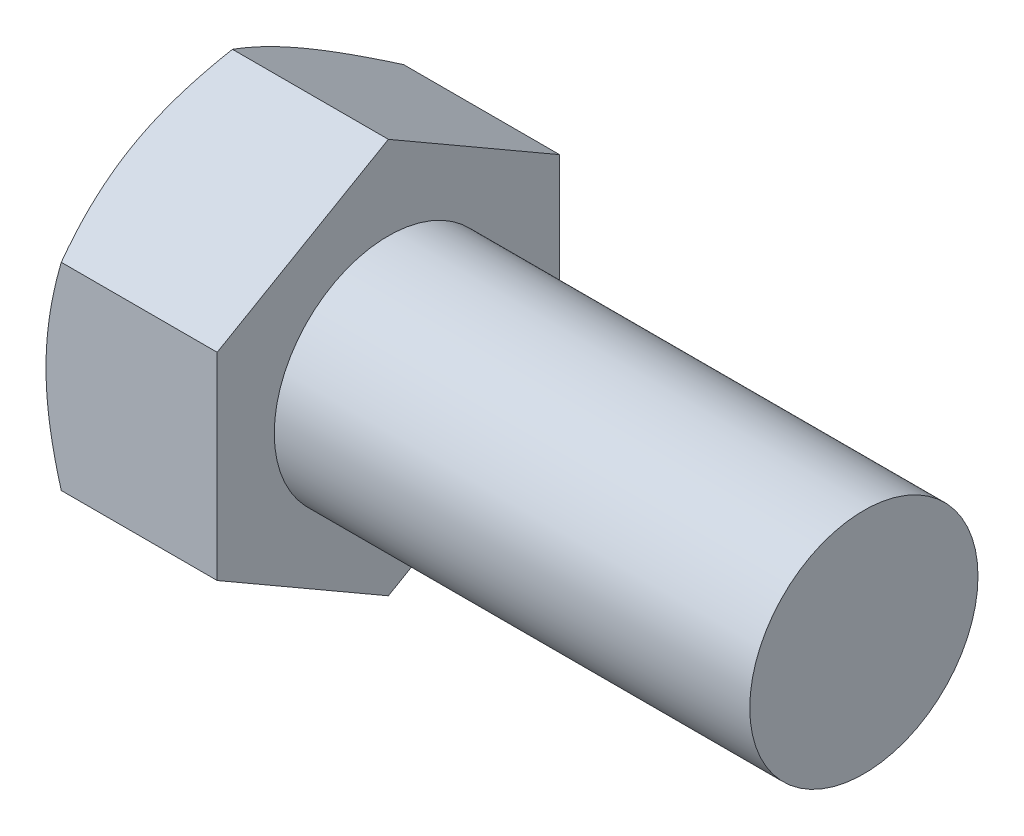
ISO-10303-21;
HEADER;
FILE_DESCRIPTION(('STEP AP214'),'2;1');
FILE_NAME('part.step','',(''),(''),'','','');
FILE_SCHEMA(('AUTOMOTIVE_DESIGN { 1 0 10303 214 1 1 1 1 }'));
ENDSEC;
DATA;
#1=APPLICATION_CONTEXT('core data for automotive mechanical design processes');
#2=APPLICATION_PROTOCOL_DEFINITION('international standard','automotive_design',2000,#1);
#3=PRODUCT_CONTEXT('',#1,'mechanical');
#4=PRODUCT('Part','Part','',(#3));
#5=PRODUCT_RELATED_PRODUCT_CATEGORY('part','',(#4));
#6=PRODUCT_DEFINITION_FORMATION('','',#4);
#7=PRODUCT_DEFINITION_CONTEXT('part definition',#1,'design');
#8=PRODUCT_DEFINITION('design','',#6,#7);
#9=PRODUCT_DEFINITION_SHAPE('','',#8);
#10=(LENGTH_UNIT() NAMED_UNIT(*) SI_UNIT(.MILLI.,.METRE.));
#11=(NAMED_UNIT(*) PLANE_ANGLE_UNIT() SI_UNIT($,.RADIAN.));
#12=(NAMED_UNIT(*) SI_UNIT($,.STERADIAN.) SOLID_ANGLE_UNIT());
#13=UNCERTAINTY_MEASURE_WITH_UNIT(LENGTH_MEASURE(1.E-05),#10,'distance_accuracy_value','');
#14=(GEOMETRIC_REPRESENTATION_CONTEXT(3) GLOBAL_UNCERTAINTY_ASSIGNED_CONTEXT((#13)) GLOBAL_UNIT_ASSIGNED_CONTEXT((#10,
#11,#12)) REPRESENTATION_CONTEXT('',''));
#15=CARTESIAN_POINT('',(0.,0.,0.));
#16=DIRECTION('',(0.,0.,1.));
#17=DIRECTION('',(1.,0.,0.));
#18=AXIS2_PLACEMENT_3D('',#15,#16,#17);
#19=CARTESIAN_POINT('',(9.,6.,0.));
#20=DIRECTION('',(-1.,0.,0.));
#21=DIRECTION('',(0.,0.,1.));
#22=AXIS2_PLACEMENT_3D('',#19,#20,#21);
#23=PLANE('',#22);
#24=CARTESIAN_POINT('',(9.,0.,0.));
#25=DIRECTION('',(-1.,0.,0.));
#26=DIRECTION('',(0.,0.,1.));
#27=AXIS2_PLACEMENT_3D('',#24,#25,#26);
#28=CIRCLE('',#27,6.);
#29=CARTESIAN_POINT('',(9.,0.,6.));
#30=VERTEX_POINT('',#29);
#31=EDGE_CURVE('E200',#30,#30,#28,.T.);
#32=ORIENTED_EDGE('',*,*,#31,.T.);
#33=EDGE_LOOP('',(#32));
#34=FACE_BOUND('',#33,.T.);
#35=DIRECTION('',(0.,1.,0.));
#36=VECTOR('',#35,1.);
#37=CARTESIAN_POINT('',(9.,-5.19615244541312,9.));
#38=LINE('',#37,#36);
#39=CARTESIAN_POINT('',(9.,-5.19615244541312,9.));
#40=VERTEX_POINT('',#39);
#41=CARTESIAN_POINT('',(9.,5.19615244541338,9.));
#42=VERTEX_POINT('',#41);
#43=EDGE_CURVE('E60',#40,#42,#38,.T.);
#44=ORIENTED_EDGE('',*,*,#43,.F.);
#45=DIRECTION('',(0.,0.500000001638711,0.866025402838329));
#46=VECTOR('',#45,1.);
#47=CARTESIAN_POINT('',(9.,-10.3923048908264,0.));
#48=LINE('',#47,#46);
#49=CARTESIAN_POINT('',(9.,-10.3923048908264,0.));
#50=VERTEX_POINT('',#49);
#51=EDGE_CURVE('E133',#50,#40,#48,.T.);
#52=ORIENTED_EDGE('',*,*,#51,.F.);
#53=DIRECTION('',(0.,-0.500000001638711,0.866025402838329));
#54=VECTOR('',#53,1.);
#55=CARTESIAN_POINT('',(9.,-5.19615244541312,-9.));
#56=LINE('',#55,#54);
#57=CARTESIAN_POINT('',(9.,-5.19615244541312,-9.));
#58=VERTEX_POINT('',#57);
#59=EDGE_CURVE('E131',#58,#50,#56,.T.);
#60=ORIENTED_EDGE('',*,*,#59,.F.);
#61=DIRECTION('',(0.,-1.,0.));
#62=VECTOR('',#61,1.);
#63=CARTESIAN_POINT('',(9.,5.19615244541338,-9.));
#64=LINE('',#63,#62);
#65=CARTESIAN_POINT('',(9.,5.19615244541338,-9.));
#66=VERTEX_POINT('',#65);
#67=EDGE_CURVE('E114',#66,#58,#64,.T.);
#68=ORIENTED_EDGE('',*,*,#67,.F.);
#69=DIRECTION('',(0.,-0.500000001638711,-0.866025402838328));
#70=VECTOR('',#69,1.);
#71=CARTESIAN_POINT('',(9.,10.3923048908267,0.));
#72=LINE('',#71,#70);
#73=CARTESIAN_POINT('',(9.,10.3923048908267,0.));
#74=VERTEX_POINT('',#73);
#75=EDGE_CURVE('E123',#74,#66,#72,.T.);
#76=ORIENTED_EDGE('',*,*,#75,.F.);
#77=DIRECTION('',(0.,0.500000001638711,-0.866025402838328));
#78=VECTOR('',#77,1.);
#79=CARTESIAN_POINT('',(9.,5.19615244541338,9.));
#80=LINE('',#79,#78);
#81=EDGE_CURVE('E127',#42,#74,#80,.T.);
#82=ORIENTED_EDGE('',*,*,#81,.F.);
#83=EDGE_LOOP('',(#44,#52,#60,#68,#76,#82));
#84=FACE_BOUND('',#83,.T.);
#85=ADVANCED_FACE('F37',(#34,#84),#23,.F.);
#86=CARTESIAN_POINT('',(-25.4,0.,0.));
#87=DIRECTION('',(-1.,0.,0.));
#88=DIRECTION('',(0.,0.,1.));
#89=AXIS2_PLACEMENT_3D('',#86,#87,#88);
#90=CYLINDRICAL_SURFACE('',#89,6.);
#91=CARTESIAN_POINT('',(34.,0.,0.));
#92=DIRECTION('',(-1.,0.,0.));
#93=DIRECTION('',(0.,0.,1.));
#94=AXIS2_PLACEMENT_3D('',#91,#92,#93);
#95=CIRCLE('',#94,6.);
#96=CARTESIAN_POINT('',(34.,0.,6.));
#97=VERTEX_POINT('',#96);
#98=EDGE_CURVE('E11',#97,#97,#95,.T.);
#99=ORIENTED_EDGE('',*,*,#98,.T.);
#100=EDGE_LOOP('',(#99));
#101=FACE_BOUND('',#100,.T.);
#102=ORIENTED_EDGE('',*,*,#31,.F.);
#103=EDGE_LOOP('',(#102));
#104=FACE_BOUND('',#103,.T.);
#105=ADVANCED_FACE('F39',(#101,#104),#90,.T.);
#106=CARTESIAN_POINT('',(34.,6.,0.));
#107=DIRECTION('',(1.,0.,0.));
#108=DIRECTION('',(0.,0.,-1.));
#109=AXIS2_PLACEMENT_3D('',#106,#107,#108);
#110=PLANE('',#109);
#111=ORIENTED_EDGE('',*,*,#98,.F.);
#112=EDGE_LOOP('',(#111));
#113=FACE_BOUND('',#112,.T.);
#114=ADVANCED_FACE('F181',(#113),#110,.T.);
#115=CARTESIAN_POINT('',(9.,-5.19615244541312,9.));
#116=DIRECTION('',(0.,0.,1.));
#117=DIRECTION('',(0.,-1.,0.));
#118=AXIS2_PLACEMENT_3D('',#115,#116,#117);
#119=PLANE('',#118);
#120=DIRECTION('',(-1.,0.,0.));
#121=VECTOR('',#120,1.);
#122=CARTESIAN_POINT('',(9.,-5.19615244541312,9.));
#123=LINE('',#122,#121);
#124=CARTESIAN_POINT('',(0.803847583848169,-5.19615244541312,9.));
#125=VERTEX_POINT('',#124);
#126=EDGE_CURVE('E140',#40,#125,#123,.T.);
#127=ORIENTED_EDGE('',*,*,#126,.F.);
#128=ORIENTED_EDGE('',*,*,#43,.T.);
#129=DIRECTION('',(-1.,0.,0.));
#130=VECTOR('',#129,1.);
#131=CARTESIAN_POINT('',(9.,5.19615244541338,9.));
#132=LINE('',#131,#130);
#133=CARTESIAN_POINT('',(0.803847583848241,5.19615244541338,9.));
#134=VERTEX_POINT('',#133);
#135=EDGE_CURVE('E139',#42,#134,#132,.T.);
#136=ORIENTED_EDGE('',*,*,#135,.T.);
#137=CARTESIAN_POINT('',(4.30675215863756,-13.7809864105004,9.00000000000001));
#138=CARTESIAN_POINT('',(4.21125056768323,-13.5834182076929,9.00000000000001));
#139=CARTESIAN_POINT('',(4.11624323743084,-13.3856112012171,9.00000000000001));
#140=CARTESIAN_POINT('',(3.92733055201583,-12.9894691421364,9.00000000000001));
#141=CARTESIAN_POINT('',(3.83342520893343,-12.7911340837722,9.));
#142=CARTESIAN_POINT('',(3.55350512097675,-12.1952030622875,9.));
#143=CARTESIAN_POINT('',(3.36931745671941,-11.7967454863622,9.));
#144=CARTESIAN_POINT('',(3.00594950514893,-10.9947966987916,9.));
#145=CARTESIAN_POINT('',(2.82680390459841,-10.5912897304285,9.));
#146=CARTESIAN_POINT('',(2.47620436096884,-9.78096004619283,9.));
#147=CARTESIAN_POINT('',(2.30475001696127,-9.3741375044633,9.));
#148=CARTESIAN_POINT('',(1.96954751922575,-8.55147796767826,9.));
#149=CARTESIAN_POINT('',(1.80591981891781,-8.13559162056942,9.));
#150=CARTESIAN_POINT('',(1.49147930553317,-7.29891466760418,9.));
#151=CARTESIAN_POINT('',(1.34066791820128,-6.87812352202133,9.));
#152=CARTESIAN_POINT('',(1.05591315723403,-6.0318265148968,9.));
#153=CARTESIAN_POINT('',(0.92193392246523,-5.60633285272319,9.));
#154=CARTESIAN_POINT('',(0.675192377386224,-4.74931186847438,9.));
#155=CARTESIAN_POINT('',(0.562423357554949,-4.3177865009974,9.));
#156=CARTESIAN_POINT('',(0.363585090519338,-3.44833526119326,9.));
#157=CARTESIAN_POINT('',(0.277522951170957,-3.01040771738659,9.));
#158=CARTESIAN_POINT('',(0.172769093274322,-2.34966278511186,9.));
#159=CARTESIAN_POINT('',(0.141905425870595,-2.12874509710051,9.));
#160=CARTESIAN_POINT('',(0.0888984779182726,-1.68587395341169,9.));
#161=CARTESIAN_POINT('',(0.0667543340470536,-1.46392060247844,9.));
#162=CARTESIAN_POINT('',(0.0317823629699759,-1.02068615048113,9.));
#163=CARTESIAN_POINT('',(0.0188966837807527,-0.799409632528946,9.));
#164=CARTESIAN_POINT('',(0.00250976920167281,-0.356509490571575,9.));
#165=CARTESIAN_POINT('',(-0.000991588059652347,-0.134885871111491,9.));
#166=CARTESIAN_POINT('',(0.00147357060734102,0.308247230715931,9.));
#167=CARTESIAN_POINT('',(0.00743742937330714,0.529756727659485,9.));
#168=CARTESIAN_POINT('',(0.0286847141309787,0.972331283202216,9.));
#169=CARTESIAN_POINT('',(0.0439686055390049,1.19339631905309,9.));
#170=CARTESIAN_POINT('',(0.0919878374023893,1.729189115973,9.));
#171=CARTESIAN_POINT('',(0.129392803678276,2.04350522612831,9.));
#172=CARTESIAN_POINT('',(0.22096768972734,2.66972888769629,9.));
#173=CARTESIAN_POINT('',(0.275142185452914,2.98163575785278,9.));
#174=CARTESIAN_POINT('',(0.398334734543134,3.60278361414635,9.));
#175=CARTESIAN_POINT('',(0.467366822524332,3.91202179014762,9.));
#176=CARTESIAN_POINT('',(0.618168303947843,4.52731652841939,9.));
#177=CARTESIAN_POINT('',(0.699936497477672,4.83337338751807,9.));
#178=CARTESIAN_POINT('',(0.876391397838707,5.44984363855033,9.));
#179=CARTESIAN_POINT('',(0.971345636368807,5.76017992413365,9.));
#180=CARTESIAN_POINT('',(1.17063619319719,6.37757223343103,9.));
#181=CARTESIAN_POINT('',(1.27496604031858,6.68463035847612,9.));
#182=CARTESIAN_POINT('',(1.49085277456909,7.29423423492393,9.));
#183=CARTESIAN_POINT('',(1.60236567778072,7.59679565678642,9.));
#184=CARTESIAN_POINT('',(1.83193669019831,8.19957103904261,9.));
#185=CARTESIAN_POINT('',(1.9499974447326,8.49978399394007,9.));
#186=CARTESIAN_POINT('',(2.07068439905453,8.79890630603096,9.));
#187=B_SPLINE_CURVE_WITH_KNOTS('',3,(#137,#138,#139,#140,#141,#142,#143,#144,#145,#146,#147,
#148,#149,#150,#151,#152,#153,#154,#155,#156,#157,#158,#159,#160,#161,#162,#163,#164,#165,#166,
#167,#168,#169,#170,#171,#172,#173,#174,#175,#176,#177,#178,#179,#180,#181,#182,#183,#184,#185,
#186),.UNSPECIFIED.,.F.,.F.,(4,2,2,2,2,2,2,2,2,2,2,2,2,2,2,2,2,2,2,2,2,2,2,2,4),(0.,
0.658317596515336,1.31664240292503,2.63350615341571,3.95790574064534,5.28223620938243,
6.62282571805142,7.96356416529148,9.3013958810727,10.6388036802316,11.9765671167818,
12.6456116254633,13.3145898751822,13.9793507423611,14.6441029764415,15.3086686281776,
15.9732674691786,16.9223404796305,17.8716726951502,18.8219056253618,19.772049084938,
20.7454827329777,21.7182495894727,22.6855410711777,23.6532262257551),.UNSPECIFIED.);
#188=CARTESIAN_POINT('',(0.,0.,9.));
#189=VERTEX_POINT('',#188);
#190=EDGE_CURVE('E183',#189,#134,#187,.T.);
#191=ORIENTED_EDGE('',*,*,#190,.F.);
#192=EDGE_CURVE('E191',#125,#189,#187,.T.);
#193=ORIENTED_EDGE('',*,*,#192,.F.);
#194=EDGE_LOOP('',(#127,#128,#136,#191,#193));
#195=FACE_BOUND('',#194,.T.);
#196=ADVANCED_FACE('F177',(#195),#119,.T.);
#197=CARTESIAN_POINT('',(9.,-10.3923048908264,0.));
#198=DIRECTION('',(0.,-0.866025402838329,0.500000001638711));
#199=DIRECTION('',(0.,-0.500000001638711,-0.866025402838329));
#200=AXIS2_PLACEMENT_3D('',#197,#198,#199);
#201=PLANE('',#200);
#202=DIRECTION('',(-1.,0.,0.));
#203=VECTOR('',#202,1.);
#204=CARTESIAN_POINT('',(9.,-10.3923048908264,0.));
#205=LINE('',#204,#203);
#206=CARTESIAN_POINT('',(0.803847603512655,-10.3923048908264,0.));
#207=VERTEX_POINT('',#206);
#208=EDGE_CURVE('E144',#50,#207,#205,.T.);
#209=ORIENTED_EDGE('',*,*,#208,.F.);
#210=ORIENTED_EDGE('',*,*,#51,.T.);
#211=ORIENTED_EDGE('',*,*,#126,.T.);
#212=CARTESIAN_POINT('',(0.803914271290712,-10.3924203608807,-0.000200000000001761));
#213=CARTESIAN_POINT('',(0.737982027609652,-10.2782164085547,0.197607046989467));
#214=CARTESIAN_POINT('',(0.675041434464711,-10.1635670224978,0.396185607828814));
#215=CARTESIAN_POINT('',(0.555969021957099,-9.93333719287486,0.794955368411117));
#216=CARTESIAN_POINT('',(0.499840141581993,-9.81775637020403,0.995147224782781));
#217=CARTESIAN_POINT('',(0.395151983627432,-9.58544919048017,1.39751506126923));
#218=CARTESIAN_POINT('',(0.346610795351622,-9.46872078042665,1.59969459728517));
#219=CARTESIAN_POINT('',(0.258148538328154,-9.23447005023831,2.00542876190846));
#220=CARTESIAN_POINT('',(0.218225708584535,-9.11694789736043,2.20898310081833));
#221=CARTESIAN_POINT('',(0.148684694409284,-8.88408936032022,2.61230591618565));
#222=CARTESIAN_POINT('',(0.118837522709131,-8.76877017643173,2.81204460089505));
#223=CARTESIAN_POINT('',(0.0687933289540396,-8.53761582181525,3.21241568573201));
#224=CARTESIAN_POINT('',(0.048595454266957,-8.4217806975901,3.41304800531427));
#225=CARTESIAN_POINT('',(0.0183543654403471,-8.18990952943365,3.81466064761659));
#226=CARTESIAN_POINT('',(0.00829962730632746,-8.07387386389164,4.01564031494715));
#227=CARTESIAN_POINT('',(-0.00143764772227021,-7.84169574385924,4.41778461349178));
#228=CARTESIAN_POINT('',(-0.0011205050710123,-7.72555329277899,4.61894923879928));
#229=CARTESIAN_POINT('',(0.00916396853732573,-7.50842144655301,4.99503262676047));
#230=CARTESIAN_POINT('',(0.0178767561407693,-7.40741674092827,5.16997790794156));
#231=CARTESIAN_POINT('',(0.0429773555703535,-7.20564391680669,5.5194586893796));
#232=CARTESIAN_POINT('',(0.059365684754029,-7.10487581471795,5.69399416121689));
#233=CARTESIAN_POINT('',(0.119656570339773,-6.80296161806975,6.21692488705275));
#234=CARTESIAN_POINT('',(0.174677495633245,-6.60234992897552,6.56439452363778));
#235=CARTESIAN_POINT('',(0.312230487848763,-6.1989985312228,7.26301963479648));
#236=CARTESIAN_POINT('',(0.395345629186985,-5.99631029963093,7.61408594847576));
#237=CARTESIAN_POINT('',(0.583982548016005,-5.59395642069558,8.31098330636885));
#238=CARTESIAN_POINT('',(0.689460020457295,-5.39428562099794,8.65682327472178));
#239=CARTESIAN_POINT('',(0.803914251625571,-5.19603697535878,9.0002));
#240=B_SPLINE_CURVE_WITH_KNOTS('',3,(#212,#213,#214,#215,#216,#217,#218,#219,#220,#221,#222,
#223,#224,#225,#226,#227,#228,#229,#230,#231,#232,#233,#234,#235,#236,#237,#238,#239),
.UNSPECIFIED.,.F.,.F.,(4,2,2,2,2,2,2,2,2,2,2,2,2,4),(0.,0.713219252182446,1.42674514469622,
2.14194698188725,2.8570025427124,3.55449750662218,4.25193082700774,4.94857087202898,
5.6451893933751,6.25162978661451,6.85811106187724,8.07193749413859,9.31268393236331,
10.5509947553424),.UNSPECIFIED.);
#241=CARTESIAN_POINT('',(0.,-7.79422865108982,4.50000002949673));
#242=VERTEX_POINT('',#241);
#243=EDGE_CURVE('E193',#242,#125,#240,.T.);
#244=ORIENTED_EDGE('',*,*,#243,.F.);
#245=EDGE_CURVE('E192',#207,#242,#240,.T.);
#246=ORIENTED_EDGE('',*,*,#245,.F.);
#247=EDGE_LOOP('',(#209,#210,#211,#244,#246));
#248=FACE_BOUND('',#247,.T.);
#249=ADVANCED_FACE('F180',(#248),#201,.T.);
#250=CARTESIAN_POINT('',(9.,-5.19615244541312,-9.));
#251=DIRECTION('',(0.,-0.866025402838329,-0.500000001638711));
#252=DIRECTION('',(0.,0.500000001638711,-0.866025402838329));
#253=AXIS2_PLACEMENT_3D('',#250,#251,#252);
#254=PLANE('',#253);
#255=DIRECTION('',(-1.,0.,0.));
#256=VECTOR('',#255,1.);
#257=CARTESIAN_POINT('',(9.,-5.19615244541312,-9.));
#258=LINE('',#257,#256);
#259=CARTESIAN_POINT('',(0.803847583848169,-5.19615244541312,-9.));
#260=VERTEX_POINT('',#259);
#261=EDGE_CURVE('E120',#58,#260,#258,.T.);
#262=ORIENTED_EDGE('',*,*,#261,.F.);
#263=ORIENTED_EDGE('',*,*,#59,.T.);
#264=ORIENTED_EDGE('',*,*,#208,.T.);
#265=CARTESIAN_POINT('',(0.803914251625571,-5.19603697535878,-9.0002));
#266=CARTESIAN_POINT('',(0.737982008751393,-5.310240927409,-8.80239295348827));
#267=CARTESIAN_POINT('',(0.675041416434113,-5.42489031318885,-8.60381439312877));
#268=CARTESIAN_POINT('',(0.55596900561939,-5.65512014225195,-8.20504463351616));
#269=CARTESIAN_POINT('',(0.499840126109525,-5.77070096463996,-8.00485277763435));
#270=CARTESIAN_POINT('',(0.395151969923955,-6.00300814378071,-7.60248494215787));
#271=CARTESIAN_POINT('',(0.34661078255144,-6.11973655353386,-7.40030540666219));
#272=CARTESIAN_POINT('',(0.258148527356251,-6.3539872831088,-6.99457124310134));
#273=CARTESIAN_POINT('',(0.21822569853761,-6.47150943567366,-6.79101690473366));
#274=CARTESIAN_POINT('',(0.148684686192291,-6.70436797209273,-6.38769409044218));
#275=CARTESIAN_POINT('',(0.118837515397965,-6.81968715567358,-6.18795540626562));
#276=CARTESIAN_POINT('',(0.0687933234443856,-7.05084150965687,-5.78758432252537));
#277=CARTESIAN_POINT('',(0.0485954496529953,-7.16667663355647,-5.58695200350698));
#278=CARTESIAN_POINT('',(0.0183543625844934,-7.39854780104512,-5.18533936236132));
#279=CARTESIAN_POINT('',(0.00829962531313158,-7.5145834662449,-4.98435969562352));
#280=CARTESIAN_POINT('',(-0.001437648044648,-7.74676158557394,-4.58221539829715));
#281=CARTESIAN_POINT('',(-0.00112050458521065,-7.86290403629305,-4.38105077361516));
#282=CARTESIAN_POINT('',(0.00916397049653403,-8.08003588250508,-4.00496738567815));
#283=CARTESIAN_POINT('',(0.0178767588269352,-8.18104058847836,-3.83002210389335));
#284=CARTESIAN_POINT('',(0.0429773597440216,-8.3828134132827,-3.48054132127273));
#285=CARTESIAN_POINT('',(0.0593656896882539,-8.48358151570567,-3.30600584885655));
#286=CARTESIAN_POINT('',(0.119656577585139,-8.78549571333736,-2.78307512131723));
#287=CARTESIAN_POINT('',(0.174677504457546,-8.98610740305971,-2.43560548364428));
#288=CARTESIAN_POINT('',(0.312230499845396,-9.3894588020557,-1.73698037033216));
#289=CARTESIAN_POINT('',(0.395345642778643,-9.59214703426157,-1.38591405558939));
#290=CARTESIAN_POINT('',(0.583982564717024,-9.9945009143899,-0.689016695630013));
#291=CARTESIAN_POINT('',(0.689460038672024,-10.1941717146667,-0.343176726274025));
#292=CARTESIAN_POINT('',(0.803914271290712,-10.3924203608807,0.000199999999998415));
#293=B_SPLINE_CURVE_WITH_KNOTS('',3,(#265,#266,#267,#268,#269,#270,#271,#272,#273,#274,#275,
#276,#277,#278,#279,#280,#281,#282,#283,#284,#285,#286,#287,#288,#289,#290,#291,#292),
.UNSPECIFIED.,.F.,.F.,(4,2,2,2,2,2,2,2,2,2,2,2,2,4),(0.,0.713219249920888,1.42674514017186,
2.14194697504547,2.85700253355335,3.55449749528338,4.25193081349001,4.94857085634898,
5.64518937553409,6.25162977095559,6.85811104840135,8.07193748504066,9.31268392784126,
10.5509947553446),.UNSPECIFIED.);
#294=CARTESIAN_POINT('',(0.,-7.79422865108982,-4.50000002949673));
#295=VERTEX_POINT('',#294);
#296=EDGE_CURVE('E223',#295,#207,#293,.T.);
#297=ORIENTED_EDGE('',*,*,#296,.F.);
#298=EDGE_CURVE('E228',#260,#295,#293,.T.);
#299=ORIENTED_EDGE('',*,*,#298,.F.);
#300=EDGE_LOOP('',(#262,#263,#264,#297,#299));
#301=FACE_BOUND('',#300,.T.);
#302=ADVANCED_FACE('F299',(#301),#254,.T.);
#303=CARTESIAN_POINT('',(9.,5.19615244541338,-9.));
#304=DIRECTION('',(0.,0.,-1.));
#305=DIRECTION('',(-1.,0.,0.));
#306=AXIS2_PLACEMENT_3D('',#303,#304,#305);
#307=PLANE('',#306);
#308=DIRECTION('',(-1.,0.,0.));
#309=VECTOR('',#308,1.);
#310=CARTESIAN_POINT('',(9.,5.19615244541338,-9.));
#311=LINE('',#310,#309);
#312=CARTESIAN_POINT('',(0.803847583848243,5.19615244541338,-9.));
#313=VERTEX_POINT('',#312);
#314=EDGE_CURVE('E109',#66,#313,#311,.T.);
#315=ORIENTED_EDGE('',*,*,#314,.F.);
#316=ORIENTED_EDGE('',*,*,#67,.T.);
#317=ORIENTED_EDGE('',*,*,#261,.T.);
#318=CARTESIAN_POINT('',(4.30675215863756,-13.7809864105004,-9.));
#319=CARTESIAN_POINT('',(4.21125056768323,-13.5834182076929,-9.));
#320=CARTESIAN_POINT('',(4.11624323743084,-13.3856112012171,-9.));
#321=CARTESIAN_POINT('',(3.92733055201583,-12.9894691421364,-9.));
#322=CARTESIAN_POINT('',(3.83342520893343,-12.7911340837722,-9.));
#323=CARTESIAN_POINT('',(3.55350512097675,-12.1952030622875,-9.));
#324=CARTESIAN_POINT('',(3.36931745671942,-11.7967454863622,-9.));
#325=CARTESIAN_POINT('',(3.00594950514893,-10.9947966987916,-9.));
#326=CARTESIAN_POINT('',(2.82680390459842,-10.5912897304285,-9.));
#327=CARTESIAN_POINT('',(2.47620436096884,-9.78096004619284,-9.));
#328=CARTESIAN_POINT('',(2.30475001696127,-9.37413750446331,-9.));
#329=CARTESIAN_POINT('',(1.96954751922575,-8.55147796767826,-9.));
#330=CARTESIAN_POINT('',(1.80591981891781,-8.13559162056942,-9.));
#331=CARTESIAN_POINT('',(1.49147930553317,-7.29891466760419,-9.));
#332=CARTESIAN_POINT('',(1.34066791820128,-6.87812352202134,-9.));
#333=CARTESIAN_POINT('',(1.05591315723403,-6.0318265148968,-9.));
#334=CARTESIAN_POINT('',(0.921933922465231,-5.60633285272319,-9.));
#335=CARTESIAN_POINT('',(0.675192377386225,-4.74931186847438,-9.));
#336=CARTESIAN_POINT('',(0.562423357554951,-4.3177865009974,-9.));
#337=CARTESIAN_POINT('',(0.363585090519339,-3.44833526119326,-9.));
#338=CARTESIAN_POINT('',(0.277522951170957,-3.01040771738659,-9.));
#339=CARTESIAN_POINT('',(0.172769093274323,-2.34966278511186,-9.));
#340=CARTESIAN_POINT('',(0.141905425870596,-2.12874509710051,-9.));
#341=CARTESIAN_POINT('',(0.088898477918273,-1.68587395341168,-9.));
#342=CARTESIAN_POINT('',(0.0667543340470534,-1.46392060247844,-9.));
#343=CARTESIAN_POINT('',(0.0317823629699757,-1.02068615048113,-9.));
#344=CARTESIAN_POINT('',(0.0188966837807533,-0.799409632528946,-9.));
#345=CARTESIAN_POINT('',(0.00250976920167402,-0.356509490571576,-9.));
#346=CARTESIAN_POINT('',(-0.000991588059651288,-0.134885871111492,-9.));
#347=CARTESIAN_POINT('',(0.001473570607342,0.308247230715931,-9.));
#348=CARTESIAN_POINT('',(0.0074374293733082,0.529756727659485,-9.));
#349=CARTESIAN_POINT('',(0.0286847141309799,0.972331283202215,-9.));
#350=CARTESIAN_POINT('',(0.0439686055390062,1.19339631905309,-9.));
#351=CARTESIAN_POINT('',(0.0919878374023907,1.729189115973,-9.));
#352=CARTESIAN_POINT('',(0.129392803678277,2.04350522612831,-9.));
#353=CARTESIAN_POINT('',(0.220967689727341,2.66972888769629,-9.));
#354=CARTESIAN_POINT('',(0.275142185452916,2.98163575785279,-9.));
#355=CARTESIAN_POINT('',(0.398334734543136,3.60278361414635,-9.));
#356=CARTESIAN_POINT('',(0.467366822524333,3.91202179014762,-9.));
#357=CARTESIAN_POINT('',(0.618168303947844,4.52731652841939,-9.));
#358=CARTESIAN_POINT('',(0.699936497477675,4.83337338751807,-9.));
#359=CARTESIAN_POINT('',(0.876391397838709,5.44984363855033,-9.));
#360=CARTESIAN_POINT('',(0.971345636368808,5.76017992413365,-9.));
#361=CARTESIAN_POINT('',(1.17063619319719,6.37757223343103,-9.));
#362=CARTESIAN_POINT('',(1.27496604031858,6.68463035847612,-9.));
#363=CARTESIAN_POINT('',(1.49085277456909,7.29423423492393,-9.));
#364=CARTESIAN_POINT('',(1.60236567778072,7.59679565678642,-9.));
#365=CARTESIAN_POINT('',(1.83193669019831,8.19957103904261,-9.));
#366=CARTESIAN_POINT('',(1.94999744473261,8.49978399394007,-9.));
#367=CARTESIAN_POINT('',(2.07068439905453,8.79890630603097,-9.));
#368=B_SPLINE_CURVE_WITH_KNOTS('',3,(#318,#319,#320,#321,#322,#323,#324,#325,#326,#327,#328,
#329,#330,#331,#332,#333,#334,#335,#336,#337,#338,#339,#340,#341,#342,#343,#344,#345,#346,#347,
#348,#349,#350,#351,#352,#353,#354,#355,#356,#357,#358,#359,#360,#361,#362,#363,#364,#365,#366,
#367),.UNSPECIFIED.,.F.,.F.,(4,2,2,2,2,2,2,2,2,2,2,2,2,2,2,2,2,2,2,2,2,2,2,2,4),(0.,
0.658317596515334,1.31664240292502,2.6335061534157,3.95790574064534,5.28223620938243,
6.62282571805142,7.96356416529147,9.3013958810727,10.6388036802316,11.9765671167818,
12.6456116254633,13.3145898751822,13.9793507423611,14.6441029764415,15.3086686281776,
15.9732674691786,16.9223404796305,17.8716726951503,18.8219056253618,19.772049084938,
20.7454827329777,21.7182495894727,22.6855410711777,23.6532262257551),.UNSPECIFIED.);
#369=CARTESIAN_POINT('',(0.,0.,-9.));
#370=VERTEX_POINT('',#369);
#371=EDGE_CURVE('E224',#370,#260,#368,.F.);
#372=ORIENTED_EDGE('',*,*,#371,.F.);
#373=EDGE_CURVE('E117',#313,#370,#368,.F.);
#374=ORIENTED_EDGE('',*,*,#373,.F.);
#375=EDGE_LOOP('',(#315,#316,#317,#372,#374));
#376=FACE_BOUND('',#375,.T.);
#377=ADVANCED_FACE('F111',(#376),#307,.T.);
#378=CARTESIAN_POINT('',(9.,10.3923048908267,0.));
#379=DIRECTION('',(0.,0.866025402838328,-0.500000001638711));
#380=DIRECTION('',(0.,0.500000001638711,0.866025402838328));
#381=AXIS2_PLACEMENT_3D('',#378,#379,#380);
#382=PLANE('',#381);
#383=DIRECTION('',(-1.,0.,0.));
#384=VECTOR('',#383,1.);
#385=CARTESIAN_POINT('',(9.,10.3923048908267,0.));
#386=LINE('',#385,#384);
#387=CARTESIAN_POINT('',(0.803847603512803,10.3923048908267,0.));
#388=VERTEX_POINT('',#387);
#389=EDGE_CURVE('E52',#74,#388,#386,.T.);
#390=ORIENTED_EDGE('',*,*,#389,.F.);
#391=ORIENTED_EDGE('',*,*,#75,.T.);
#392=ORIENTED_EDGE('',*,*,#314,.T.);
#393=CARTESIAN_POINT('',(0.80391427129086,10.392420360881,0.000199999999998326));
#394=CARTESIAN_POINT('',(0.737982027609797,10.278216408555,-0.197607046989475));
#395=CARTESIAN_POINT('',(0.675041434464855,10.1635670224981,-0.396185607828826));
#396=CARTESIAN_POINT('',(0.555969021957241,9.93333719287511,-0.79495536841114));
#397=CARTESIAN_POINT('',(0.499840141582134,9.81775637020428,-0.995147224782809));
#398=CARTESIAN_POINT('',(0.39515198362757,9.58544919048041,-1.39751506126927));
#399=CARTESIAN_POINT('',(0.346610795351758,9.46872078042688,-1.59969459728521));
#400=CARTESIAN_POINT('',(0.258148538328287,9.23447005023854,-2.00542876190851));
#401=CARTESIAN_POINT('',(0.218225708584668,9.11694789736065,-2.20898310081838));
#402=CARTESIAN_POINT('',(0.148684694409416,8.88408936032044,-2.61230591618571));
#403=CARTESIAN_POINT('',(0.118837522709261,8.76877017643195,-2.81204460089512));
#404=CARTESIAN_POINT('',(0.0687933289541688,8.53761582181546,-3.21241568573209));
#405=CARTESIAN_POINT('',(0.0485954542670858,8.42178069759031,-3.41304800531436));
#406=CARTESIAN_POINT('',(0.0183543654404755,8.18990952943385,-3.81466064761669));
#407=CARTESIAN_POINT('',(0.00829962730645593,8.07387386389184,-4.01564031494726));
#408=CARTESIAN_POINT('',(-0.00143764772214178,7.84169574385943,-4.41778461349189));
#409=CARTESIAN_POINT('',(-0.00112050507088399,7.72555329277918,-4.61894923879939));
#410=CARTESIAN_POINT('',(0.00916396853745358,7.5084214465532,-4.99503262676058));
#411=CARTESIAN_POINT('',(0.0178767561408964,7.40741674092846,-5.16997790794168));
#412=CARTESIAN_POINT('',(0.0429773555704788,7.20564391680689,-5.5194586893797));
#413=CARTESIAN_POINT('',(0.0593656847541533,7.10487581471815,-5.69399416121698));
#414=CARTESIAN_POINT('',(0.119656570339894,6.80296161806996,-6.21692488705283));
#415=CARTESIAN_POINT('',(0.174677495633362,6.60234992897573,-6.56439452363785));
#416=CARTESIAN_POINT('',(0.31223048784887,6.19899853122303,-7.26301963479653));
#417=CARTESIAN_POINT('',(0.395345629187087,5.99631029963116,-7.6140859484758));
#418=CARTESIAN_POINT('',(0.583982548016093,5.59395642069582,-8.31098330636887));
#419=CARTESIAN_POINT('',(0.689460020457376,5.39428562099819,-8.65682327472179));
#420=CARTESIAN_POINT('',(0.803914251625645,5.19603697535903,-9.0002));
#421=B_SPLINE_CURVE_WITH_KNOTS('',3,(#393,#394,#395,#396,#397,#398,#399,#400,#401,#402,#403,
#404,#405,#406,#407,#408,#409,#410,#411,#412,#413,#414,#415,#416,#417,#418,#419,#420),
.UNSPECIFIED.,.F.,.F.,(4,2,2,2,2,2,2,2,2,2,2,2,2,4),(0.,0.713219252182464,1.42674514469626,
2.14194698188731,2.85700254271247,3.55449750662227,4.25193082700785,4.9485708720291,
5.64518939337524,6.25162978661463,6.85811106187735,8.07193749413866,9.31268393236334,
10.5509947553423),.UNSPECIFIED.);
#422=CARTESIAN_POINT('',(0.,7.79422865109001,-4.50000002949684));
#423=VERTEX_POINT('',#422);
#424=EDGE_CURVE('E159',#423,#313,#421,.T.);
#425=ORIENTED_EDGE('',*,*,#424,.F.);
#426=EDGE_CURVE('E287',#388,#423,#421,.T.);
#427=ORIENTED_EDGE('',*,*,#426,.F.);
#428=EDGE_LOOP('',(#390,#391,#392,#425,#427));
#429=FACE_BOUND('',#428,.T.);
#430=ADVANCED_FACE('F124',(#429),#382,.T.);
#431=CARTESIAN_POINT('',(9.,5.19615244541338,9.));
#432=DIRECTION('',(0.,0.866025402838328,0.500000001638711));
#433=DIRECTION('',(0.,-0.500000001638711,0.866025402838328));
#434=AXIS2_PLACEMENT_3D('',#431,#432,#433);
#435=PLANE('',#434);
#436=ORIENTED_EDGE('',*,*,#135,.F.);
#437=ORIENTED_EDGE('',*,*,#81,.T.);
#438=ORIENTED_EDGE('',*,*,#389,.T.);
#439=CARTESIAN_POINT('',(0.803914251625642,5.19603697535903,9.0002));
#440=CARTESIAN_POINT('',(0.737982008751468,5.31024092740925,8.80239295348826));
#441=CARTESIAN_POINT('',(0.675041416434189,5.4248903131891,8.60381439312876));
#442=CARTESIAN_POINT('',(0.555969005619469,5.65512014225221,8.20504463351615));
#443=CARTESIAN_POINT('',(0.499840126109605,5.77070096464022,8.00485277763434));
#444=CARTESIAN_POINT('',(0.395151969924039,6.00300814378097,7.60248494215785));
#445=CARTESIAN_POINT('',(0.346610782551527,6.11973655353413,7.40030540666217));
#446=CARTESIAN_POINT('',(0.258148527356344,6.35398728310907,6.99457124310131));
#447=CARTESIAN_POINT('',(0.218225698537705,6.47150943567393,6.79101690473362));
#448=CARTESIAN_POINT('',(0.14868468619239,6.704367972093,6.38769409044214));
#449=CARTESIAN_POINT('',(0.118837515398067,6.81968715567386,6.18795540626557));
#450=CARTESIAN_POINT('',(0.0687933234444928,7.05084150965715,5.78758432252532));
#451=CARTESIAN_POINT('',(0.0485954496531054,7.16667663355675,5.58695200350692));
#452=CARTESIAN_POINT('',(0.0183543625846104,7.39854780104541,5.18533936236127));
#453=CARTESIAN_POINT('',(0.00829962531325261,7.51458346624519,4.98435969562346));
#454=CARTESIAN_POINT('',(-0.00143764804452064,7.74676158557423,4.58221539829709));
#455=CARTESIAN_POINT('',(-0.00112050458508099,7.86290403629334,4.3810507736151));
#456=CARTESIAN_POINT('',(0.00916397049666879,8.08003588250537,4.00496738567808));
#457=CARTESIAN_POINT('',(0.0178767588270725,8.18104058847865,3.83002210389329));
#458=CARTESIAN_POINT('',(0.0429773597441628,8.38281341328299,3.48054132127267));
#459=CARTESIAN_POINT('',(0.0593656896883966,8.48358151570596,3.30600584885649));
#460=CARTESIAN_POINT('',(0.119656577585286,8.78549571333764,2.78307512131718));
#461=CARTESIAN_POINT('',(0.174677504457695,8.98610740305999,2.43560548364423));
#462=CARTESIAN_POINT('',(0.312230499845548,9.38945880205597,1.73698037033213));
#463=CARTESIAN_POINT('',(0.395345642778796,9.59214703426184,1.38591405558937));
#464=CARTESIAN_POINT('',(0.583982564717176,9.99450091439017,0.68901669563));
#465=CARTESIAN_POINT('',(0.689460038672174,10.1941717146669,0.343176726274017));
#466=CARTESIAN_POINT('',(0.80391427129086,10.392420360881,-0.000200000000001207));
#467=B_SPLINE_CURVE_WITH_KNOTS('',3,(#439,#440,#441,#442,#443,#444,#445,#446,#447,#448,#449,
#450,#451,#452,#453,#454,#455,#456,#457,#458,#459,#460,#461,#462,#463,#464,#465,#466),
.UNSPECIFIED.,.F.,.F.,(4,2,2,2,2,2,2,2,2,2,2,2,2,4),(0.,0.713219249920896,1.42674514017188,
2.1419469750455,2.85700253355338,3.55449749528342,4.25193081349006,4.94857085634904,
5.64518937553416,6.25162977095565,6.8581110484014,8.07193748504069,9.31268392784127,
10.5509947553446),.UNSPECIFIED.);
#468=CARTESIAN_POINT('',(0.,7.79422865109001,4.50000002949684));
#469=VERTEX_POINT('',#468);
#470=EDGE_CURVE('E143',#469,#388,#467,.T.);
#471=ORIENTED_EDGE('',*,*,#470,.F.);
#472=EDGE_CURVE('E158',#134,#469,#467,.T.);
#473=ORIENTED_EDGE('',*,*,#472,.F.);
#474=EDGE_LOOP('',(#436,#437,#438,#471,#473));
#475=FACE_BOUND('',#474,.T.);
#476=ADVANCED_FACE('F170',(#475),#435,.T.);
#477=CARTESIAN_POINT('',(0.,0.,0.));
#478=DIRECTION('',(1.,0.,0.));
#479=DIRECTION('',(0.,0.,-1.));
#480=AXIS2_PLACEMENT_3D('',#477,#478,#479);
#481=CONICAL_SURFACE('',#480,9.,1.0471975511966);
#482=CARTESIAN_POINT('',(0.,0.,0.));
#483=DIRECTION('',(-1.,0.,0.));
#484=DIRECTION('',(0.,0.,1.));
#485=AXIS2_PLACEMENT_3D('',#482,#483,#484);
#486=CIRCLE('',#485,9.);
#487=EDGE_CURVE('E202',#242,#189,#486,.T.);
#488=ORIENTED_EDGE('',*,*,#487,.F.);
#489=ORIENTED_EDGE('',*,*,#243,.T.);
#490=ORIENTED_EDGE('',*,*,#192,.T.);
#491=EDGE_LOOP('',(#488,#489,#490));
#492=FACE_BOUND('',#491,.T.);
#493=ADVANCED_FACE('F174',(#492),#481,.T.);
#494=EDGE_CURVE('E210',#295,#242,#486,.T.);
#495=ORIENTED_EDGE('',*,*,#494,.F.);
#496=ORIENTED_EDGE('',*,*,#296,.T.);
#497=ORIENTED_EDGE('',*,*,#245,.T.);
#498=EDGE_LOOP('',(#495,#496,#497));
#499=FACE_BOUND('',#498,.T.);
#500=ADVANCED_FACE('F233',(#499),#481,.T.);
#501=ORIENTED_EDGE('',*,*,#371,.T.);
#502=ORIENTED_EDGE('',*,*,#298,.T.);
#503=EDGE_CURVE('E213',#370,#295,#486,.T.);
#504=ORIENTED_EDGE('',*,*,#503,.F.);
#505=EDGE_LOOP('',(#501,#502,#504));
#506=FACE_BOUND('',#505,.T.);
#507=ADVANCED_FACE('F166',(#506),#481,.T.);
#508=ORIENTED_EDGE('',*,*,#424,.T.);
#509=ORIENTED_EDGE('',*,*,#373,.T.);
#510=EDGE_CURVE('E209',#423,#370,#486,.T.);
#511=ORIENTED_EDGE('',*,*,#510,.F.);
#512=EDGE_LOOP('',(#508,#509,#511));
#513=FACE_BOUND('',#512,.T.);
#514=ADVANCED_FACE('F222',(#513),#481,.T.);
#515=EDGE_CURVE('E45',#189,#469,#486,.T.);
#516=ORIENTED_EDGE('',*,*,#515,.F.);
#517=ORIENTED_EDGE('',*,*,#190,.T.);
#518=ORIENTED_EDGE('',*,*,#472,.T.);
#519=EDGE_LOOP('',(#516,#517,#518));
#520=FACE_BOUND('',#519,.T.);
#521=ADVANCED_FACE('F261',(#520),#481,.T.);
#522=CARTESIAN_POINT('',(0.,0.,0.));
#523=DIRECTION('',(-1.,0.,0.));
#524=DIRECTION('',(0.,0.,1.));
#525=AXIS2_PLACEMENT_3D('',#522,#523,#524);
#526=PLANE('',#525);
#527=CARTESIAN_POINT('',(0.,0.,0.));
#528=DIRECTION('',(1.,0.,0.));
#529=DIRECTION('',(0.,0.,-1.));
#530=AXIS2_PLACEMENT_3D('',#527,#528,#529);
#531=CIRCLE('',#530,7.875);
#532=CARTESIAN_POINT('',(0.,0.,-7.875));
#533=VERTEX_POINT('',#532);
#534=EDGE_CURVE('E241',#533,#533,#531,.T.);
#535=ORIENTED_EDGE('',*,*,#534,.T.);
#536=EDGE_LOOP('',(#535));
#537=FACE_BOUND('',#536,.T.);
#538=ORIENTED_EDGE('',*,*,#515,.T.);
#539=EDGE_CURVE('E204',#469,#423,#486,.T.);
#540=ORIENTED_EDGE('',*,*,#539,.T.);
#541=ORIENTED_EDGE('',*,*,#510,.T.);
#542=ORIENTED_EDGE('',*,*,#503,.T.);
#543=ORIENTED_EDGE('',*,*,#494,.T.);
#544=ORIENTED_EDGE('',*,*,#487,.T.);
#545=EDGE_LOOP('',(#538,#540,#541,#542,#543,#544));
#546=FACE_BOUND('',#545,.T.);
#547=ADVANCED_FACE('F219',(#537,#546),#526,.T.);
#548=ORIENTED_EDGE('',*,*,#470,.T.);
#549=ORIENTED_EDGE('',*,*,#426,.T.);
#550=ORIENTED_EDGE('',*,*,#539,.F.);
#551=EDGE_LOOP('',(#548,#549,#550));
#552=FACE_BOUND('',#551,.T.);
#553=ADVANCED_FACE('F251',(#552),#481,.T.);
#554=CARTESIAN_POINT('',(1.125,0.,0.));
#555=DIRECTION('',(-1.,0.,0.));
#556=DIRECTION('',(0.,0.,1.));
#557=AXIS2_PLACEMENT_3D('',#554,#555,#556);
#558=CYLINDRICAL_SURFACE('',#557,7.875);
#559=CARTESIAN_POINT('',(1.125,0.,0.));
#560=DIRECTION('',(1.,0.,0.));
#561=DIRECTION('',(0.,0.,-1.));
#562=AXIS2_PLACEMENT_3D('',#559,#560,#561);
#563=CIRCLE('',#562,7.875);
#564=CARTESIAN_POINT('',(1.125,0.,-7.875));
#565=VERTEX_POINT('',#564);
#566=EDGE_CURVE('E238',#565,#565,#563,.T.);
#567=ORIENTED_EDGE('',*,*,#566,.T.);
#568=EDGE_LOOP('',(#567));
#569=FACE_BOUND('',#568,.T.);
#570=ORIENTED_EDGE('',*,*,#534,.F.);
#571=EDGE_LOOP('',(#570));
#572=FACE_BOUND('',#571,.T.);
#573=ADVANCED_FACE('F248',(#569,#572),#558,.F.);
#574=CARTESIAN_POINT('',(1.125,0.,0.));
#575=DIRECTION('',(1.,0.,0.));
#576=DIRECTION('',(0.,0.,-1.));
#577=AXIS2_PLACEMENT_3D('',#574,#575,#576);
#578=PLANE('',#577);
#579=ORIENTED_EDGE('',*,*,#566,.F.);
#580=EDGE_LOOP('',(#579));
#581=FACE_BOUND('',#580,.T.);
#582=ADVANCED_FACE('F250',(#581),#578,.F.);
#583=CLOSED_SHELL('',(#85,#105,#114,#196,#249,#302,#377,#430,#476,#493,#500,#507,#514,#521,#547,
#553,#573,#582));
#584=MANIFOLD_SOLID_BREP('B2',#583);
#585=ADVANCED_BREP_SHAPE_REPRESENTATION('',(#18,#584),#14);
#586=SHAPE_DEFINITION_REPRESENTATION(#9,#585);
ENDSEC;
END-ISO-10303-21;
